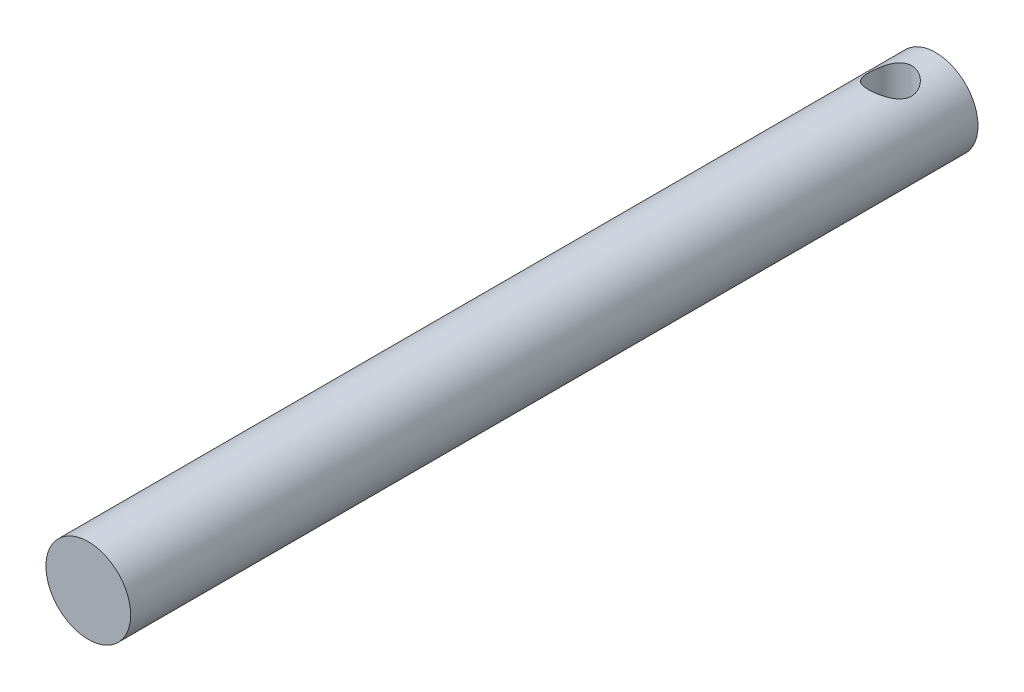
ISO-10303-21;
HEADER;
FILE_DESCRIPTION(('STEP AP214'),'2;1');
FILE_NAME('part.step','',(''),(''),'','','');
FILE_SCHEMA(('AUTOMOTIVE_DESIGN { 1 0 10303 214 1 1 1 1 }'));
ENDSEC;
DATA;
#1=APPLICATION_CONTEXT('core data for automotive mechanical design processes');
#2=APPLICATION_PROTOCOL_DEFINITION('international standard','automotive_design',2000,#1);
#3=PRODUCT_CONTEXT('',#1,'mechanical');
#4=PRODUCT('Part','Part','',(#3));
#5=PRODUCT_RELATED_PRODUCT_CATEGORY('part','',(#4));
#6=PRODUCT_DEFINITION_FORMATION('','',#4);
#7=PRODUCT_DEFINITION_CONTEXT('part definition',#1,'design');
#8=PRODUCT_DEFINITION('design','',#6,#7);
#9=PRODUCT_DEFINITION_SHAPE('','',#8);
#10=(LENGTH_UNIT() NAMED_UNIT(*) SI_UNIT(.MILLI.,.METRE.));
#11=(NAMED_UNIT(*) PLANE_ANGLE_UNIT() SI_UNIT($,.RADIAN.));
#12=(NAMED_UNIT(*) SI_UNIT($,.STERADIAN.) SOLID_ANGLE_UNIT());
#13=UNCERTAINTY_MEASURE_WITH_UNIT(LENGTH_MEASURE(1.E-05),#10,'distance_accuracy_value','');
#14=(GEOMETRIC_REPRESENTATION_CONTEXT(3) GLOBAL_UNCERTAINTY_ASSIGNED_CONTEXT((#13)) GLOBAL_UNIT_ASSIGNED_CONTEXT((#10,
#11,#12)) REPRESENTATION_CONTEXT('',''));
#15=CARTESIAN_POINT('',(0.,0.,0.));
#16=DIRECTION('',(0.,0.,1.));
#17=DIRECTION('',(1.,0.,0.));
#18=AXIS2_PLACEMENT_3D('',#15,#16,#17);
#19=CARTESIAN_POINT('',(0.448059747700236,0.512871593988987,200.));
#20=DIRECTION('',(0.,0.,-1.));
#21=DIRECTION('',(-1.,0.,0.));
#22=AXIS2_PLACEMENT_3D('',#19,#20,#21);
#23=CYLINDRICAL_SURFACE('',#22,10.);
#24=CARTESIAN_POINT('',(0.290429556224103,-9.48588596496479,15.5237132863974));
#25=CARTESIAN_POINT('',(0.421394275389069,-9.48795031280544,15.5237129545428));
#26=CARTESIAN_POINT('',(0.552406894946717,-9.48743639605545,15.5185619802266));
#27=CARTESIAN_POINT('',(0.813553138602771,-9.48130090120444,15.4979977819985));
#28=CARTESIAN_POINT('',(0.943686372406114,-9.47567718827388,15.4825802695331));
#29=CARTESIAN_POINT('',(1.20221736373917,-9.45949241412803,15.441618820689));
#30=CARTESIAN_POINT('',(1.33061252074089,-9.44892464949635,15.4160611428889));
#31=CARTESIAN_POINT('',(1.58461210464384,-9.42315150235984,15.355085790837));
#32=CARTESIAN_POINT('',(1.71021537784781,-9.4079442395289,15.3196641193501));
#33=CARTESIAN_POINT('',(1.95723597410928,-9.37337495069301,15.2394893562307));
#34=CARTESIAN_POINT('',(2.07866844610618,-9.35403034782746,15.1947754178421));
#35=CARTESIAN_POINT('',(2.31717823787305,-9.31164362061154,15.0963446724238));
#36=CARTESIAN_POINT('',(2.4342538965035,-9.28860010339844,15.0426244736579));
#37=CARTESIAN_POINT('',(2.77782770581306,-9.21476337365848,14.8686686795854));
#38=CARTESIAN_POINT('',(2.99694116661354,-9.15922453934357,14.7355498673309));
#39=CARTESIAN_POINT('',(3.42270206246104,-9.03717705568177,14.4303014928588));
#40=CARTESIAN_POINT('',(3.62792660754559,-8.97022351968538,14.2563805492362));
#41=CARTESIAN_POINT('',(4.00775209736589,-8.8342839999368,13.8783248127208));
#42=CARTESIAN_POINT('',(4.18233128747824,-8.76529661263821,13.6741687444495));
#43=CARTESIAN_POINT('',(4.50955329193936,-8.62705536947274,13.2223324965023));
#44=CARTESIAN_POINT('',(4.65944309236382,-8.55819614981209,12.9725043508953));
#45=CARTESIAN_POINT('',(4.85073203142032,-8.46607560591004,12.5791879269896));
#46=CARTESIAN_POINT('',(4.90891952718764,-8.43722144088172,12.4449330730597));
#47=CARTESIAN_POINT('',(5.01354080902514,-8.38430886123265,12.1710347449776));
#48=CARTESIAN_POINT('',(5.05998127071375,-8.36024772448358,12.0313943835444));
#49=CARTESIAN_POINT('',(5.13845454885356,-8.31900601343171,11.7550603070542));
#50=CARTESIAN_POINT('',(5.17110640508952,-8.30153480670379,11.6185854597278));
#51=CARTESIAN_POINT('',(5.22487761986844,-8.27251103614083,11.3428220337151));
#52=CARTESIAN_POINT('',(5.24600291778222,-8.26095542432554,11.2035349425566));
#53=CARTESIAN_POINT('',(5.27642189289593,-8.24425247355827,10.9233690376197));
#54=CARTESIAN_POINT('',(5.28572217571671,-8.23910155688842,10.7824911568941));
#55=CARTESIAN_POINT('',(5.2923650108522,-8.23542672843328,10.5003729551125));
#56=CARTESIAN_POINT('',(5.28970864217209,-8.23690221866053,10.359132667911));
#57=CARTESIAN_POINT('',(5.27345602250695,-8.24587368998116,10.0934612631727));
#58=CARTESIAN_POINT('',(5.26112412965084,-8.25267369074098,9.96892668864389));
#59=CARTESIAN_POINT('',(5.22722834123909,-8.27120039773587,9.72145332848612));
#60=CARTESIAN_POINT('',(5.20566151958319,-8.28292866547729,9.59851506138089));
#61=CARTESIAN_POINT('',(5.15353969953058,-8.31092190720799,9.35510501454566));
#62=CARTESIAN_POINT('',(5.12298598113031,-8.32718623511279,9.23463288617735));
#63=CARTESIAN_POINT('',(5.05320445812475,-8.36373739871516,8.99683616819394));
#64=CARTESIAN_POINT('',(5.01397325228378,-8.38402581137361,8.87951283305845));
#65=CARTESIAN_POINT('',(4.88204455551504,-8.45092608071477,8.52866334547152));
#66=CARTESIAN_POINT('',(4.77613237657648,-8.50299420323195,8.30099120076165));
#67=CARTESIAN_POINT('',(4.53275323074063,-8.61583111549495,7.86570247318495));
#68=CARTESIAN_POINT('',(4.39527223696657,-8.67660376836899,7.65809486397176));
#69=CARTESIAN_POINT('',(4.07363263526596,-8.80854973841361,7.24282123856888));
#70=CARTESIAN_POINT('',(3.88587612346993,-8.88010295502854,7.03805366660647));
#71=CARTESIAN_POINT('',(3.47810383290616,-9.01944859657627,6.66163369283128));
#72=CARTESIAN_POINT('',(3.2580745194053,-9.08723942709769,6.48999525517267));
#73=CARTESIAN_POINT('',(2.90280555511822,-9.18198009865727,6.25796191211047));
#74=CARTESIAN_POINT('',(2.77749544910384,-9.21292728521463,6.18368761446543));
#75=CARTESIAN_POINT('',(2.52018802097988,-9.27097418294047,6.04605400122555));
#76=CARTESIAN_POINT('',(2.38819356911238,-9.29807552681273,5.98269005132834));
#77=CARTESIAN_POINT('',(2.11845879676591,-9.34758317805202,5.86755503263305));
#78=CARTESIAN_POINT('',(1.98072082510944,-9.36999138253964,5.81577927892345));
#79=CARTESIAN_POINT('',(1.70051102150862,-9.40939479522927,5.72440327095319));
#80=CARTESIAN_POINT('',(1.55803971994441,-9.42639060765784,5.68480165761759));
#81=CARTESIAN_POINT('',(1.28151841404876,-9.45322198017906,5.62104251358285));
#82=CARTESIAN_POINT('',(1.1477458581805,-9.46353330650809,5.59587890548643));
#83=CARTESIAN_POINT('',(0.878296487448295,-9.47877985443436,5.55652642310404));
#84=CARTESIAN_POINT('',(0.74261982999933,-9.48371551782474,5.54233664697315));
#85=CARTESIAN_POINT('',(0.470520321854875,-9.48802858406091,5.52509890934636));
#86=CARTESIAN_POINT('',(0.334097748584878,-9.48740792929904,5.52204705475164));
#87=CARTESIAN_POINT('',(0.0616020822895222,-9.48058740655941,5.52709386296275));
#88=CARTESIAN_POINT('',(-0.0744710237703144,-9.47438774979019,5.53519210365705));
#89=CARTESIAN_POINT('',(-0.335322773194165,-9.45719068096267,5.5614202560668));
#90=CARTESIAN_POINT('',(-0.460204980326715,-9.44657372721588,5.57878023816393));
#91=CARTESIAN_POINT('',(-0.707895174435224,-9.42087280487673,5.62277707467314));
#92=CARTESIAN_POINT('',(-0.830702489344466,-9.40578741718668,5.64941687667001));
#93=CARTESIAN_POINT('',(-1.07338854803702,-9.37146969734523,5.71167794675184));
#94=CARTESIAN_POINT('',(-1.19326813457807,-9.35223857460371,5.74729659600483));
#95=CARTESIAN_POINT('',(-1.42945470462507,-9.31002851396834,5.82716514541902));
#96=CARTESIAN_POINT('',(-1.54576029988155,-9.28704814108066,5.87141835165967));
#97=CARTESIAN_POINT('',(-1.89603883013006,-9.21149613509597,6.01982905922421));
#98=CARTESIAN_POINT('',(-2.12326791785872,-9.15349599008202,6.1375537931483));
#99=CARTESIAN_POINT('',(-2.55527404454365,-9.02813309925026,6.40465670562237));
#100=CARTESIAN_POINT('',(-2.76004111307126,-8.96076622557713,6.55404885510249));
#101=CARTESIAN_POINT('',(-3.16350569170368,-8.81488871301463,6.89776321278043));
#102=CARTESIAN_POINT('',(-3.35947500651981,-8.73594114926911,7.09510753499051));
#103=CARTESIAN_POINT('',(-3.71672172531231,-8.58067576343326,7.52040674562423));
#104=CARTESIAN_POINT('',(-3.87797346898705,-8.50435992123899,7.74838407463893));
#105=CARTESIAN_POINT('',(-4.0939069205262,-8.39653097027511,8.11558223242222));
#106=CARTESIAN_POINT('',(-4.16279811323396,-8.3609724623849,8.24544597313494));
#107=CARTESIAN_POINT('',(-4.2892176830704,-8.2941318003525,8.51162270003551));
#108=CARTESIAN_POINT('',(-4.34675137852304,-8.26284764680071,8.64793263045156));
#109=CARTESIAN_POINT('',(-4.44975002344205,-8.20578255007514,8.92600725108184));
#110=CARTESIAN_POINT('',(-4.49522627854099,-8.17999645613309,9.06776668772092));
#111=CARTESIAN_POINT('',(-4.57353225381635,-8.1349986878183,9.35575452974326));
#112=CARTESIAN_POINT('',(-4.6063641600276,-8.11578587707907,9.50198215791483));
#113=CARTESIAN_POINT('',(-4.65609485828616,-8.08645088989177,9.78211436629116));
#114=CARTESIAN_POINT('',(-4.67429978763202,-8.07558874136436,9.91571054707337));
#115=CARTESIAN_POINT('',(-4.69985983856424,-8.0602929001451,10.1842974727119));
#116=CARTESIAN_POINT('',(-4.70721619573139,-8.05585847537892,10.319288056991));
#117=CARTESIAN_POINT('',(-4.71096259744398,-8.0536033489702,10.5894267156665));
#118=CARTESIAN_POINT('',(-4.70735660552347,-8.05578025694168,10.7245747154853));
#119=CARTESIAN_POINT('',(-4.68924581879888,-8.06665067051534,10.9938669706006));
#120=CARTESIAN_POINT('',(-4.67474149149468,-8.07534389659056,11.1280112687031));
#121=CARTESIAN_POINT('',(-4.63708325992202,-8.09768848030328,11.3805771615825));
#122=CARTESIAN_POINT('',(-4.61496207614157,-8.11074391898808,11.4992072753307));
#123=CARTESIAN_POINT('',(-4.56237024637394,-8.14140537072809,11.7340143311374));
#124=CARTESIAN_POINT('',(-4.53189704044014,-8.15901277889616,11.8501905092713));
#125=CARTESIAN_POINT('',(-4.42839860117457,-8.2179079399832,12.1939987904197));
#126=CARTESIAN_POINT('',(-4.34327091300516,-8.26528345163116,12.4170661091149));
#127=CARTESIAN_POINT('',(-4.13646380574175,-8.37513910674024,12.8619018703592));
#128=CARTESIAN_POINT('',(-4.01260416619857,-8.43845770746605,13.0824343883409));
#129=CARTESIAN_POINT('',(-3.73429938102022,-8.57182285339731,13.5010891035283));
#130=CARTESIAN_POINT('',(-3.57983786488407,-8.64187298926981,13.6991992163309));
#131=CARTESIAN_POINT('',(-3.22113537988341,-8.79194315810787,14.0943103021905));
#132=CARTESIAN_POINT('',(-3.01302455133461,-8.87206759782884,14.2877692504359));
#133=CARTESIAN_POINT('',(-2.56509565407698,-9.02530259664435,14.6379168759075));
#134=CARTESIAN_POINT('',(-2.32525849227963,-9.09840888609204,14.7945832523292));
#135=CARTESIAN_POINT('',(-1.94419290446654,-9.19768023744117,14.998946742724));
#136=CARTESIAN_POINT('',(-1.81255739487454,-9.22923443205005,15.0623161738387));
#137=CARTESIAN_POINT('',(-1.54340555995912,-9.28779073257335,15.1775764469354));
#138=CARTESIAN_POINT('',(-1.40589215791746,-9.31479506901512,15.2294729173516));
#139=CARTESIAN_POINT('',(-1.12628775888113,-9.36344010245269,15.3210577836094));
#140=CARTESIAN_POINT('',(-0.984207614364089,-9.3850925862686,15.3607730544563));
#141=CARTESIAN_POINT('',(-0.696417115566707,-9.42247936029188,15.4275821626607));
#142=CARTESIAN_POINT('',(-0.55070905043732,-9.43821728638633,15.4546837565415));
#143=CARTESIAN_POINT('',(-0.289111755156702,-9.46058578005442,15.491364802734));
#144=CARTESIAN_POINT('',(-0.173676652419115,-9.46845580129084,15.5034811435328));
#145=CARTESIAN_POINT('',(0.0579695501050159,-9.48018978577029,15.5196557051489));
#146=CARTESIAN_POINT('',(0.174180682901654,-9.48405357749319,15.5237135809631));
#147=CARTESIAN_POINT('',(0.290429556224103,-9.48588596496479,15.5237132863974));
#148=B_SPLINE_CURVE_WITH_KNOTS('',3,(#24,#25,#26,#27,#28,#29,#30,#31,#32,#33,#34,#35,#36,#37,
#38,#39,#40,#41,#42,#43,#44,#45,#46,#47,#48,#49,#50,#51,#52,#53,#54,#55,#56,#57,#58,#59,#60,#61,
#62,#63,#64,#65,#66,#67,#68,#69,#70,#71,#72,#73,#74,#75,#76,#77,#78,#79,#80,#81,#82,#83,#84,#85,
#86,#87,#88,#89,#90,#91,#92,#93,#94,#95,#96,#97,#98,#99,#100,#101,#102,#103,#104,#105,#106,#107,
#108,#109,#110,#111,#112,#113,#114,#115,#116,#117,#118,#119,#120,#121,#122,#123,#124,#125,#126,
#127,#128,#129,#130,#131,#132,#133,#134,#135,#136,#137,#138,#139,#140,#141,#142,#143,#144,#145,
#146,#147),.UNSPECIFIED.,.T.,.F.,(4,2,2,2,2,2,2,2,2,2,2,2,2,2,2,2,2,2,2,2,2,2,2,2,2,2,2,2,2,2,2,
2,2,2,2,2,2,2,2,2,2,2,2,2,2,2,2,2,2,2,2,2,2,2,2,2,2,2,2,2,2,4),(0.,0.392829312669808,
0.785822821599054,1.17935072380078,1.57303832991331,1.96509958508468,2.35730882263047,
3.14088136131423,3.96912646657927,4.79795717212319,5.69109630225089,6.13800020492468,
6.58464956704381,7.0082863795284,7.43170469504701,7.85488637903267,8.2780298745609,
8.65356966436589,9.02922853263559,9.40483392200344,9.78058679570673,10.5465575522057,
11.312869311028,12.1698343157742,13.027159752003,13.4734180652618,13.9194863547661,
14.3653739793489,14.8112118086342,15.2201939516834,15.6291424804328,16.037948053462,
16.4467381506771,16.8258885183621,17.2051594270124,17.5843198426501,17.9636257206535,
18.7473085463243,19.531337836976,20.3949884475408,21.2592752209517,21.7124919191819,
22.1654958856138,22.6180735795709,23.0705729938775,23.4758032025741,23.8809872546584,
24.2860248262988,24.6910450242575,25.0547684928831,25.4186035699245,26.1458052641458,
26.9250605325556,27.7047337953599,28.5864995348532,29.4687983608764,29.9166694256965,
30.3643202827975,30.8109762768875,31.2573572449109,31.6060313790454,31.954720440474),.UNSPECIFIED.);
#149=CARTESIAN_POINT('',(0.290429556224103,-9.48588596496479,15.5237132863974));
#150=VERTEX_POINT('',#149);
#151=EDGE_CURVE('E35',#150,#150,#148,.T.);
#152=ORIENTED_EDGE('',*,*,#151,.T.);
#153=EDGE_LOOP('',(#152));
#154=FACE_BOUND('',#153,.T.);
#155=CARTESIAN_POINT('',(0.290429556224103,10.5116291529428,15.5237132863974));
#156=CARTESIAN_POINT('',(0.1583999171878,10.5095472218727,15.5237127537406));
#157=CARTESIAN_POINT('',(0.02640044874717,10.504844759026,15.5184775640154));
#158=CARTESIAN_POINT('',(-0.236538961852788,10.4902798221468,15.4976160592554));
#159=CARTESIAN_POINT('',(-0.367478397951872,10.4804150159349,15.4819850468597));
#160=CARTESIAN_POINT('',(-0.627454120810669,10.4557255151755,15.4405051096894));
#161=CARTESIAN_POINT('',(-0.75648726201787,10.4408934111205,15.4146409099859));
#162=CARTESIAN_POINT('',(-1.01158392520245,10.406607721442,15.3529979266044));
#163=CARTESIAN_POINT('',(-1.13764619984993,10.3871522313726,15.317215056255));
#164=CARTESIAN_POINT('',(-1.38536967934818,10.3441615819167,15.2363127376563));
#165=CARTESIAN_POINT('',(-1.50704830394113,10.320645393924,15.1912365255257));
#166=CARTESIAN_POINT('',(-1.74592019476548,10.2699915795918,15.0920855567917));
#167=CARTESIAN_POINT('',(-1.86311175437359,10.2428525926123,15.0380074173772));
#168=CARTESIAN_POINT('',(-2.20687072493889,10.1568834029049,14.8630109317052));
#169=CARTESIAN_POINT('',(-2.42589953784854,10.0934509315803,14.7292390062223));
#170=CARTESIAN_POINT('',(-2.85276715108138,9.95523166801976,14.4216581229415));
#171=CARTESIAN_POINT('',(-3.05899036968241,9.87997783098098,14.2458333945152));
#172=CARTESIAN_POINT('',(-3.44038365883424,9.72819457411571,13.8634837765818));
#173=CARTESIAN_POINT('',(-3.61552827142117,9.65166416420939,13.6569339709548));
#174=CARTESIAN_POINT('',(-3.94340416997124,9.49898684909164,13.1994689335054));
#175=CARTESIAN_POINT('',(-4.09335028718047,9.42332838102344,12.9463569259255));
#176=CARTESIAN_POINT('',(-4.28407862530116,9.32264167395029,12.5474891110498));
#177=CARTESIAN_POINT('',(-4.34196833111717,9.29120553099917,12.4112900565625));
#178=CARTESIAN_POINT('',(-4.44572562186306,9.23378784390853,12.1333087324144));
#179=CARTESIAN_POINT('',(-4.49160064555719,9.20780292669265,11.9915299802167));
#180=CARTESIAN_POINT('',(-4.56801900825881,9.16392731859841,11.713201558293));
#181=CARTESIAN_POINT('',(-4.59938884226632,9.1456083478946,11.5769458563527));
#182=CARTESIAN_POINT('',(-4.65066322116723,9.11542429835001,11.3016512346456));
#183=CARTESIAN_POINT('',(-4.67057403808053,9.10355568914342,11.1626138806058));
#184=CARTESIAN_POINT('',(-4.69862053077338,9.08678266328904,10.8830269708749));
#185=CARTESIAN_POINT('',(-4.70676381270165,9.08187374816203,10.7424784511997));
#186=CARTESIAN_POINT('',(-4.71115729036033,9.07922956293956,10.4611345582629));
#187=CARTESIAN_POINT('',(-4.70740868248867,9.08149357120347,10.320339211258));
#188=CARTESIAN_POINT('',(-4.68932475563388,9.09234523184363,10.0577843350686));
#189=CARTESIAN_POINT('',(-4.67640194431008,9.10008876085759,9.93588912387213));
#190=CARTESIAN_POINT('',(-4.64172446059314,9.12068803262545,9.69376252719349));
#191=CARTESIAN_POINT('',(-4.61996704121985,9.13354536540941,9.57353167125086));
#192=CARTESIAN_POINT('',(-4.56787592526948,9.16395804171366,9.33556384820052));
#193=CARTESIAN_POINT('',(-4.53754311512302,9.18151289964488,9.21782662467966));
#194=CARTESIAN_POINT('',(-4.46862198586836,9.22078805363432,8.9854890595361));
#195=CARTESIAN_POINT('',(-4.43003041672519,9.24250998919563,8.87088997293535));
#196=CARTESIAN_POINT('',(-4.30014151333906,9.31426736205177,8.52678578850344));
#197=CARTESIAN_POINT('',(-4.1960892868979,9.3700597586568,8.30314764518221));
#198=CARTESIAN_POINT('',(-3.95776539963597,9.49098458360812,7.87552395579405));
#199=CARTESIAN_POINT('',(-3.82348005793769,9.5561212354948,7.67154736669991));
#200=CARTESIAN_POINT('',(-3.50731890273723,9.69922138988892,7.25977335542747));
#201=CARTESIAN_POINT('',(-3.32145779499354,9.77772601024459,7.05521386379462));
#202=CARTESIAN_POINT('',(-2.91775936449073,9.93188644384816,6.67876211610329));
#203=CARTESIAN_POINT('',(-2.69990504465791,10.0075407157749,6.50688733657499));
#204=CARTESIAN_POINT('',(-2.34631478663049,10.1153630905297,6.27294369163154));
#205=CARTESIAN_POINT('',(-2.22043458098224,10.1511837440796,6.19737187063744));
#206=CARTESIAN_POINT('',(-1.96174451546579,10.2190905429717,6.05724701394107));
#207=CARTESIAN_POINT('',(-1.82893758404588,10.251178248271,5.99268937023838));
#208=CARTESIAN_POINT('',(-1.55730492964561,10.3107205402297,5.87529796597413));
#209=CARTESIAN_POINT('',(-1.41848163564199,10.3381769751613,5.82245952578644));
#210=CARTESIAN_POINT('',(-1.13580780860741,10.3876849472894,5.72913409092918));
#211=CARTESIAN_POINT('',(-0.991957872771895,10.4097371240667,5.68864563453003));
#212=CARTESIAN_POINT('',(-0.712531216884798,10.4462098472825,5.62341568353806));
#213=CARTESIAN_POINT('',(-0.577256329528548,10.4611112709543,5.59764754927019));
#214=CARTESIAN_POINT('',(-0.30456336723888,10.4854484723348,5.55732883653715));
#215=CARTESIAN_POINT('',(-0.167145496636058,10.4948847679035,5.54277719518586));
#216=CARTESIAN_POINT('',(0.108638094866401,10.5080626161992,5.52510978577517));
#217=CARTESIAN_POINT('',(0.247003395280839,10.5118065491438,5.52198923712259));
#218=CARTESIAN_POINT('',(0.523548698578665,10.5135424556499,5.52723666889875));
#219=CARTESIAN_POINT('',(0.661728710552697,10.5115347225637,5.5356040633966));
#220=CARTESIAN_POINT('',(0.925279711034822,10.502274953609,5.56256149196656));
#221=CARTESIAN_POINT('',(1.05076067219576,10.4954727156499,5.58024396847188));
#222=CARTESIAN_POINT('',(1.29973876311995,10.4773198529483,5.62500941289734));
#223=CARTESIAN_POINT('',(1.42323525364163,10.4659677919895,5.65209534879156));
#224=CARTESIAN_POINT('',(1.66735286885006,10.4390185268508,5.71539009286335));
#225=CARTESIAN_POINT('',(1.7879749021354,10.4234226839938,5.75159597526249));
#226=CARTESIAN_POINT('',(2.02566639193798,10.3883778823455,5.832790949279));
#227=CARTESIAN_POINT('',(2.14273446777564,10.3689274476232,5.87778340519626));
#228=CARTESIAN_POINT('',(2.49279866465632,10.3045003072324,6.02762093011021));
#229=CARTESIAN_POINT('',(2.71921155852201,10.2540757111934,6.14590914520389));
#230=CARTESIAN_POINT('',(3.14970752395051,10.1435869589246,6.41409014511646));
#231=CARTESIAN_POINT('',(3.35378138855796,10.0835188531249,6.56399588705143));
#232=CARTESIAN_POINT('',(3.75447501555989,9.95300316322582,6.90757063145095));
#233=CARTESIAN_POINT('',(3.94855004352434,9.88211152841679,7.10404253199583));
#234=CARTESIAN_POINT('',(4.30226963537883,9.74224411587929,7.52686591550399));
#235=CARTESIAN_POINT('',(4.46189182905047,9.67326960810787,7.75323665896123));
#236=CARTESIAN_POINT('',(4.67579559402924,9.57558767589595,8.11752007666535));
#237=CARTESIAN_POINT('',(4.74411493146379,9.54330717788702,8.24641846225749));
#238=CARTESIAN_POINT('',(4.86950896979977,9.48257814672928,8.51041837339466));
#239=CARTESIAN_POINT('',(4.92658860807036,9.45412793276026,8.64551714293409));
#240=CARTESIAN_POINT('',(5.0288601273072,9.40216638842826,8.92095131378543));
#241=CARTESIAN_POINT('',(5.07406045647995,9.37865155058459,9.06128291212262));
#242=CARTESIAN_POINT('',(5.15204106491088,9.33752508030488,9.34620069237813));
#243=CARTESIAN_POINT('',(5.18482306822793,9.31991262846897,9.49078628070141));
#244=CARTESIAN_POINT('',(5.23516220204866,9.29264345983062,9.7700888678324));
#245=CARTESIAN_POINT('',(5.25380449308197,9.28242342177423,9.90455588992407));
#246=CARTESIAN_POINT('',(5.28009365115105,9.26796591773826,10.1748758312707));
#247=CARTESIAN_POINT('',(5.28774157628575,9.26372787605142,10.3107286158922));
#248=CARTESIAN_POINT('',(5.29193032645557,9.26140995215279,10.5826110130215));
#249=CARTESIAN_POINT('',(5.28847492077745,9.26332798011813,10.7186405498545));
#250=CARTESIAN_POINT('',(5.2705173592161,9.27323727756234,10.9897387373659));
#251=CARTESIAN_POINT('',(5.25601563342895,9.28122831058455,11.1248074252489));
#252=CARTESIAN_POINT('',(5.21795754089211,9.30198405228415,11.3808514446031));
#253=CARTESIAN_POINT('',(5.19532828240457,9.31425721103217,11.5020057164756));
#254=CARTESIAN_POINT('',(5.14133770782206,9.34316433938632,11.7418343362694));
#255=CARTESIAN_POINT('',(5.10997366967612,9.35979966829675,11.8605078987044));
#256=CARTESIAN_POINT('',(5.00322347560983,9.41551132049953,12.2117154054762));
#257=CARTESIAN_POINT('',(4.9151543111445,9.4604077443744,12.4396008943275));
#258=CARTESIAN_POINT('',(4.70154079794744,9.5639909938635,12.8919724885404));
#259=CARTESIAN_POINT('',(4.57398253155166,9.62336920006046,13.1153368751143));
#260=CARTESIAN_POINT('',(4.28717390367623,9.74789623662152,13.538931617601));
#261=CARTESIAN_POINT('',(4.12790758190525,9.81304796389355,13.7391502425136));
#262=CARTESIAN_POINT('',(3.76096925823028,9.9504043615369,14.1342321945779));
#263=CARTESIAN_POINT('',(3.5498681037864,10.0225783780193,14.325962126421));
#264=CARTESIAN_POINT('',(3.21002000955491,10.1246183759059,14.5852880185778));
#265=CARTESIAN_POINT('',(3.09276584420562,10.1576193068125,14.667073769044));
#266=CARTESIAN_POINT('',(2.85112537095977,10.2206431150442,14.8206067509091));
#267=CARTESIAN_POINT('',(2.72674239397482,10.2506673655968,14.8923586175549));
#268=CARTESIAN_POINT('',(2.47142170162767,10.3069065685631,15.0252705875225));
#269=CARTESIAN_POINT('',(2.34047633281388,10.3331169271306,15.0864179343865));
#270=CARTESIAN_POINT('',(2.07310678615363,10.3808829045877,15.1973621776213));
#271=CARTESIAN_POINT('',(1.93668534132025,10.4024408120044,15.2471646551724));
#272=CARTESIAN_POINT('',(1.65964809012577,10.4401851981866,15.334773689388));
#273=CARTESIAN_POINT('',(1.51904206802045,10.4563832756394,15.372606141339));
#274=CARTESIAN_POINT('',(1.23460204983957,10.4829131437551,15.4359169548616));
#275=CARTESIAN_POINT('',(1.09077006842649,10.4932484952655,15.4614028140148));
#276=CARTESIAN_POINT('',(0.837431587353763,10.5058798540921,15.494908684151));
#277=CARTESIAN_POINT('',(0.728350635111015,10.5095410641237,15.5057044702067));
#278=CARTESIAN_POINT('',(0.509649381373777,10.513279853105,15.5201070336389));
#279=CARTESIAN_POINT('',(0.400029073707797,10.5133573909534,15.5237137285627));
#280=CARTESIAN_POINT('',(0.290429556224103,10.5116291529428,15.5237132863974));
#281=B_SPLINE_CURVE_WITH_KNOTS('',3,(#155,#156,#157,#158,#159,#160,#161,#162,#163,#164,#165,
#166,#167,#168,#169,#170,#171,#172,#173,#174,#175,#176,#177,#178,#179,#180,#181,#182,#183,#184,
#185,#186,#187,#188,#189,#190,#191,#192,#193,#194,#195,#196,#197,#198,#199,#200,#201,#202,#203,
#204,#205,#206,#207,#208,#209,#210,#211,#212,#213,#214,#215,#216,#217,#218,#219,#220,#221,#222,
#223,#224,#225,#226,#227,#228,#229,#230,#231,#232,#233,#234,#235,#236,#237,#238,#239,#240,#241,
#242,#243,#244,#245,#246,#247,#248,#249,#250,#251,#252,#253,#254,#255,#256,#257,#258,#259,#260,
#261,#262,#263,#264,#265,#266,#267,#268,#269,#270,#271,#272,#273,#274,#275,#276,#277,#278,#279,
#280),.UNSPECIFIED.,.T.,.F.,(4,2,2,2,2,2,2,2,2,2,2,2,2,2,2,2,2,2,2,2,2,2,2,2,2,2,2,2,2,2,2,2,2,
2,2,2,2,2,2,2,2,2,2,2,2,2,2,2,2,2,2,2,2,2,2,2,2,2,2,2,2,2,4),(0.,0.396029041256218,
0.79223715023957,1.18903891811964,1.58600441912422,1.9811631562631,2.37647072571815,
3.1662077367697,4.006533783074,4.84754503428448,5.75366970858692,6.20700042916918,
6.66004980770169,7.08248738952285,7.50469353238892,7.92662665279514,8.34851732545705,
8.71655247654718,9.08470215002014,9.45281378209,9.82107054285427,10.5765022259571,
11.3322764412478,12.1906135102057,13.0494082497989,13.5022883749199,13.9549785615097,
14.4074876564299,14.8599431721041,15.2749166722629,15.6898508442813,16.104611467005,
16.5193509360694,16.8996157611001,17.2800007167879,17.6602637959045,18.0406727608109,
18.8182742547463,19.5961950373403,20.4479312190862,21.3002187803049,21.7479596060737,
22.1955033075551,22.6427278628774,23.089890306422,23.497738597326,23.9055476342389,
24.3132182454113,24.720872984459,25.092023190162,25.4632891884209,26.2053252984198,
26.9941808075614,27.7834343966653,28.6614305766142,29.1011484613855,29.5406625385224,
29.9807017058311,30.4205239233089,30.859388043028,31.2979853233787,31.6267304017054,
31.9554792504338),.UNSPECIFIED.);
#282=CARTESIAN_POINT('',(0.290429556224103,10.5116291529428,15.5237132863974));
#283=VERTEX_POINT('',#282);
#284=EDGE_CURVE('E49',#283,#283,#281,.T.);
#285=ORIENTED_EDGE('',*,*,#284,.T.);
#286=EDGE_LOOP('',(#285));
#287=FACE_BOUND('',#286,.T.);
#288=CARTESIAN_POINT('',(0.448059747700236,0.512871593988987,200.));
#289=DIRECTION('',(0.,0.,1.));
#290=DIRECTION('',(1.,0.,0.));
#291=AXIS2_PLACEMENT_3D('',#288,#289,#290);
#292=CIRCLE('',#291,10.);
#293=CARTESIAN_POINT('',(10.4480597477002,0.512871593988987,200.));
#294=VERTEX_POINT('',#293);
#295=EDGE_CURVE('E10',#294,#294,#292,.T.);
#296=ORIENTED_EDGE('',*,*,#295,.F.);
#297=EDGE_LOOP('',(#296));
#298=FACE_BOUND('',#297,.T.);
#299=CARTESIAN_POINT('',(0.448059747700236,0.512871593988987,0.));
#300=DIRECTION('',(0.,0.,1.));
#301=DIRECTION('',(1.,0.,0.));
#302=AXIS2_PLACEMENT_3D('',#299,#300,#301);
#303=CIRCLE('',#302,10.);
#304=CARTESIAN_POINT('',(10.4480597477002,0.512871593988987,0.));
#305=VERTEX_POINT('',#304);
#306=EDGE_CURVE('E43',#305,#305,#303,.T.);
#307=ORIENTED_EDGE('',*,*,#306,.T.);
#308=EDGE_LOOP('',(#307));
#309=FACE_BOUND('',#308,.T.);
#310=ADVANCED_FACE('F31',(#154,#287,#298,#309),#23,.T.);
#311=CARTESIAN_POINT('',(0.448059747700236,0.512871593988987,200.));
#312=DIRECTION('',(0.,0.,1.));
#313=DIRECTION('',(1.,0.,0.));
#314=AXIS2_PLACEMENT_3D('',#311,#312,#313);
#315=PLANE('',#314);
#316=ORIENTED_EDGE('',*,*,#295,.T.);
#317=EDGE_LOOP('',(#316));
#318=FACE_BOUND('',#317,.T.);
#319=ADVANCED_FACE('F60',(#318),#315,.T.);
#320=CARTESIAN_POINT('',(0.448059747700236,0.512871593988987,0.));
#321=DIRECTION('',(0.,0.,1.));
#322=DIRECTION('',(1.,0.,0.));
#323=AXIS2_PLACEMENT_3D('',#320,#321,#322);
#324=PLANE('',#323);
#325=ORIENTED_EDGE('',*,*,#306,.F.);
#326=EDGE_LOOP('',(#325));
#327=FACE_BOUND('',#326,.T.);
#328=ADVANCED_FACE('F58',(#327),#324,.F.);
#329=CARTESIAN_POINT('',(0.290429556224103,-100.,10.5237132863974));
#330=DIRECTION('',(0.,1.,0.));
#331=DIRECTION('',(0.,0.,1.));
#332=AXIS2_PLACEMENT_3D('',#329,#330,#331);
#333=CYLINDRICAL_SURFACE('',#332,5.);
#334=ORIENTED_EDGE('',*,*,#284,.F.);
#335=EDGE_LOOP('',(#334));
#336=FACE_BOUND('',#335,.T.);
#337=ORIENTED_EDGE('',*,*,#151,.F.);
#338=EDGE_LOOP('',(#337));
#339=FACE_BOUND('',#338,.T.);
#340=ADVANCED_FACE('F54',(#336,#339),#333,.F.);
#341=CLOSED_SHELL('',(#310,#319,#328,#340));
#342=MANIFOLD_SOLID_BREP('B2',#341);
#343=ADVANCED_BREP_SHAPE_REPRESENTATION('',(#18,#342),#14);
#344=SHAPE_DEFINITION_REPRESENTATION(#9,#343);
ENDSEC;
END-ISO-10303-21;
